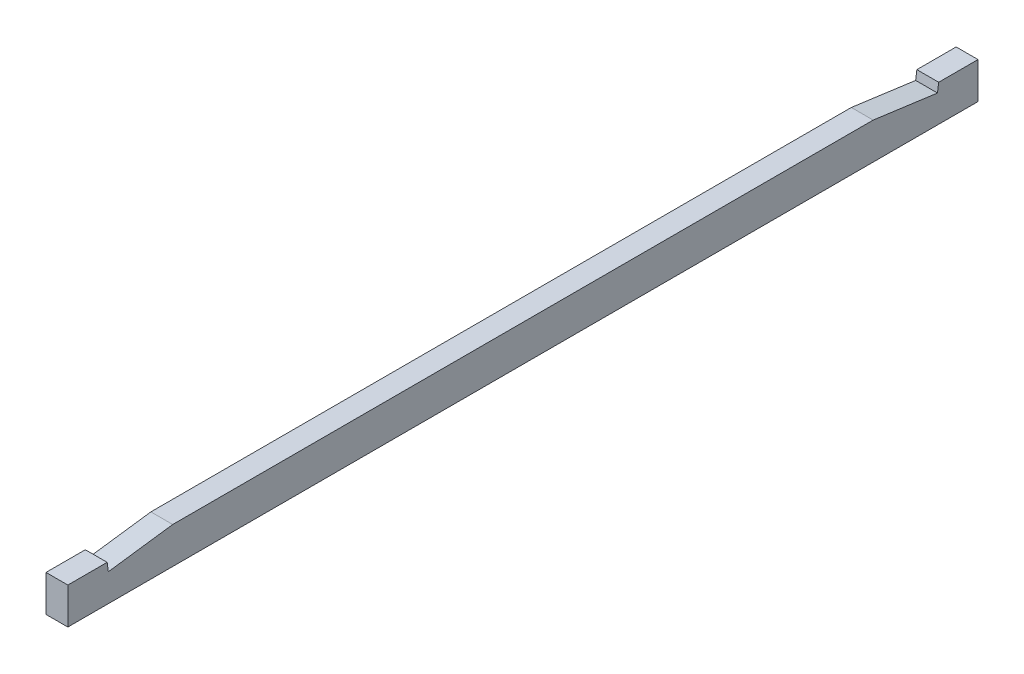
ISO-10303-21;
HEADER;
FILE_DESCRIPTION(('STEP AP214'),'2;1');
FILE_NAME('part.step','',(''),(''),'','','');
FILE_SCHEMA(('AUTOMOTIVE_DESIGN { 1 0 10303 214 1 1 1 1 }'));
ENDSEC;
DATA;
#1=APPLICATION_CONTEXT('core data for automotive mechanical design processes');
#2=APPLICATION_PROTOCOL_DEFINITION('international standard','automotive_design',2000,#1);
#3=PRODUCT_CONTEXT('',#1,'mechanical');
#4=PRODUCT('Part','Part','',(#3));
#5=PRODUCT_RELATED_PRODUCT_CATEGORY('part','',(#4));
#6=PRODUCT_DEFINITION_FORMATION('','',#4);
#7=PRODUCT_DEFINITION_CONTEXT('part definition',#1,'design');
#8=PRODUCT_DEFINITION('design','',#6,#7);
#9=PRODUCT_DEFINITION_SHAPE('','',#8);
#10=(LENGTH_UNIT() NAMED_UNIT(*) SI_UNIT(.MILLI.,.METRE.));
#11=(NAMED_UNIT(*) PLANE_ANGLE_UNIT() SI_UNIT($,.RADIAN.));
#12=(NAMED_UNIT(*) SI_UNIT($,.STERADIAN.) SOLID_ANGLE_UNIT());
#13=UNCERTAINTY_MEASURE_WITH_UNIT(LENGTH_MEASURE(1.E-05),#10,'distance_accuracy_value','');
#14=(GEOMETRIC_REPRESENTATION_CONTEXT(3) GLOBAL_UNCERTAINTY_ASSIGNED_CONTEXT((#13)) GLOBAL_UNIT_ASSIGNED_CONTEXT((#10,
#11,#12)) REPRESENTATION_CONTEXT('',''));
#15=CARTESIAN_POINT('',(0.,0.,0.));
#16=DIRECTION('',(0.,0.,1.));
#17=DIRECTION('',(1.,0.,0.));
#18=AXIS2_PLACEMENT_3D('',#15,#16,#17);
#19=CARTESIAN_POINT('',(0.,25.,625.));
#20=DIRECTION('',(0.,-1.,0.));
#21=DIRECTION('',(0.,0.,-1.));
#22=AXIS2_PLACEMENT_3D('',#19,#20,#21);
#23=PLANE('',#22);
#24=DIRECTION('',(0.,0.,-1.));
#25=VECTOR('',#24,1.);
#26=CARTESIAN_POINT('',(0.,25.,625.));
#27=LINE('',#26,#25);
#28=CARTESIAN_POINT('',(0.,25.0000000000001,553.));
#29=VERTEX_POINT('',#28);
#30=CARTESIAN_POINT('',(0.,25.,72.0000000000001));
#31=VERTEX_POINT('',#30);
#32=EDGE_CURVE('E49',#29,#31,#27,.T.);
#33=ORIENTED_EDGE('',*,*,#32,.F.);
#34=DIRECTION('',(-1.,0.,0.));
#35=VECTOR('',#34,1.);
#36=CARTESIAN_POINT('',(15.,25.0000000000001,553.));
#37=LINE('',#36,#35);
#38=CARTESIAN_POINT('',(15.,25.0000000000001,553.));
#39=VERTEX_POINT('',#38);
#40=EDGE_CURVE('E115',#39,#29,#37,.T.);
#41=ORIENTED_EDGE('',*,*,#40,.F.);
#42=DIRECTION('',(0.,0.,-1.));
#43=VECTOR('',#42,1.);
#44=CARTESIAN_POINT('',(15.,25.,625.));
#45=LINE('',#44,#43);
#46=CARTESIAN_POINT('',(15.,25.,72.0000000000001));
#47=VERTEX_POINT('',#46);
#48=EDGE_CURVE('E171',#39,#47,#45,.T.);
#49=ORIENTED_EDGE('',*,*,#48,.T.);
#50=DIRECTION('',(-1.,0.,0.));
#51=VECTOR('',#50,1.);
#52=CARTESIAN_POINT('',(15.,25.,72.0000000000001));
#53=LINE('',#52,#51);
#54=EDGE_CURVE('E143',#47,#31,#53,.T.);
#55=ORIENTED_EDGE('',*,*,#54,.T.);
#56=EDGE_LOOP('',(#33,#41,#49,#55));
#57=FACE_BOUND('',#56,.T.);
#58=ADVANCED_FACE('F26',(#57),#23,.F.);
#59=CARTESIAN_POINT('',(0.,25.,27.));
#60=VERTEX_POINT('',#59);
#61=CARTESIAN_POINT('',(0.,25.,0.));
#62=VERTEX_POINT('',#61);
#63=EDGE_CURVE('E166',#60,#62,#27,.T.);
#64=ORIENTED_EDGE('',*,*,#63,.F.);
#65=DIRECTION('',(-1.,0.,0.));
#66=VECTOR('',#65,1.);
#67=CARTESIAN_POINT('',(15.,25.,27.));
#68=LINE('',#67,#66);
#69=CARTESIAN_POINT('',(15.,25.,27.));
#70=VERTEX_POINT('',#69);
#71=EDGE_CURVE('E140',#70,#60,#68,.T.);
#72=ORIENTED_EDGE('',*,*,#71,.F.);
#73=CARTESIAN_POINT('',(15.,25.,0.));
#74=VERTEX_POINT('',#73);
#75=EDGE_CURVE('E168',#70,#74,#45,.T.);
#76=ORIENTED_EDGE('',*,*,#75,.T.);
#77=DIRECTION('',(-1.,0.,0.));
#78=VECTOR('',#77,1.);
#79=CARTESIAN_POINT('',(0.,25.,0.));
#80=LINE('',#79,#78);
#81=EDGE_CURVE('E154',#74,#62,#80,.T.);
#82=ORIENTED_EDGE('',*,*,#81,.T.);
#83=EDGE_LOOP('',(#64,#72,#76,#82));
#84=FACE_BOUND('',#83,.T.);
#85=ADVANCED_FACE('F188',(#84),#23,.F.);
#86=CARTESIAN_POINT('',(0.,0.,625.));
#87=DIRECTION('',(1.,0.,0.));
#88=DIRECTION('',(0.,0.,-1.));
#89=AXIS2_PLACEMENT_3D('',#86,#87,#88);
#90=PLANE('',#89);
#91=DIRECTION('',(0.,0.990905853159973,0.134557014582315));
#92=VECTOR('',#91,1.);
#93=CARTESIAN_POINT('',(0.,25.0000000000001,598.));
#94=LINE('',#93,#92);
#95=CARTESIAN_POINT('',(0.,19.0000000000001,597.185248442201));
#96=VERTEX_POINT('',#95);
#97=CARTESIAN_POINT('',(0.,25.,598.));
#98=VERTEX_POINT('',#97);
#99=EDGE_CURVE('E41',#96,#98,#94,.T.);
#100=ORIENTED_EDGE('',*,*,#99,.F.);
#101=DIRECTION('',(0.,-0.1345570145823,0.990905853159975));
#102=VECTOR('',#101,1.);
#103=CARTESIAN_POINT('',(0.,19.0000000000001,597.185248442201));
#104=LINE('',#103,#102);
#105=EDGE_CURVE('E112',#29,#96,#104,.T.);
#106=ORIENTED_EDGE('',*,*,#105,.F.);
#107=ORIENTED_EDGE('',*,*,#32,.T.);
#108=DIRECTION('',(0.,0.1345570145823,0.990905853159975));
#109=VECTOR('',#108,1.);
#110=CARTESIAN_POINT('',(0.,19.,27.8147515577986));
#111=LINE('',#110,#109);
#112=CARTESIAN_POINT('',(0.,19.,27.8147515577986));
#113=VERTEX_POINT('',#112);
#114=EDGE_CURVE('E131',#113,#31,#111,.T.);
#115=ORIENTED_EDGE('',*,*,#114,.F.);
#116=DIRECTION('',(0.,-0.990905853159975,0.134557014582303));
#117=VECTOR('',#116,1.);
#118=CARTESIAN_POINT('',(0.,25.,27.));
#119=LINE('',#118,#117);
#120=EDGE_CURVE('E127',#60,#113,#119,.T.);
#121=ORIENTED_EDGE('',*,*,#120,.F.);
#122=ORIENTED_EDGE('',*,*,#63,.T.);
#123=DIRECTION('',(0.,-1.,0.));
#124=VECTOR('',#123,1.);
#125=CARTESIAN_POINT('',(0.,0.,0.));
#126=LINE('',#125,#124);
#127=CARTESIAN_POINT('',(0.,0.,0.));
#128=VERTEX_POINT('',#127);
#129=EDGE_CURVE('E142',#62,#128,#126,.T.);
#130=ORIENTED_EDGE('',*,*,#129,.T.);
#131=DIRECTION('',(0.,0.,-1.));
#132=VECTOR('',#131,1.);
#133=CARTESIAN_POINT('',(0.,0.,625.));
#134=LINE('',#133,#132);
#135=CARTESIAN_POINT('',(0.,0.,625.));
#136=VERTEX_POINT('',#135);
#137=EDGE_CURVE('E11',#136,#128,#134,.T.);
#138=ORIENTED_EDGE('',*,*,#137,.F.);
#139=DIRECTION('',(0.,-1.,0.));
#140=VECTOR('',#139,1.);
#141=CARTESIAN_POINT('',(0.,0.,625.));
#142=LINE('',#141,#140);
#143=CARTESIAN_POINT('',(0.,25.,625.));
#144=VERTEX_POINT('',#143);
#145=EDGE_CURVE('E157',#144,#136,#142,.T.);
#146=ORIENTED_EDGE('',*,*,#145,.F.);
#147=EDGE_CURVE('E120',#144,#98,#27,.T.);
#148=ORIENTED_EDGE('',*,*,#147,.T.);
#149=EDGE_LOOP('',(#100,#106,#107,#115,#121,#122,#130,#138,#146,#148));
#150=FACE_BOUND('',#149,.T.);
#151=ADVANCED_FACE('F28',(#150),#90,.F.);
#152=CARTESIAN_POINT('',(0.,0.,625.));
#153=DIRECTION('',(0.,1.,0.));
#154=DIRECTION('',(0.,0.,1.));
#155=AXIS2_PLACEMENT_3D('',#152,#153,#154);
#156=PLANE('',#155);
#157=DIRECTION('',(1.,0.,0.));
#158=VECTOR('',#157,1.);
#159=CARTESIAN_POINT('',(0.,0.,0.));
#160=LINE('',#159,#158);
#161=CARTESIAN_POINT('',(15.,0.,0.));
#162=VERTEX_POINT('',#161);
#163=EDGE_CURVE('E149',#128,#162,#160,.T.);
#164=ORIENTED_EDGE('',*,*,#163,.T.);
#165=DIRECTION('',(0.,0.,-1.));
#166=VECTOR('',#165,1.);
#167=CARTESIAN_POINT('',(15.,0.,625.));
#168=LINE('',#167,#166);
#169=CARTESIAN_POINT('',(15.,0.,625.));
#170=VERTEX_POINT('',#169);
#171=EDGE_CURVE('E34',#170,#162,#168,.T.);
#172=ORIENTED_EDGE('',*,*,#171,.F.);
#173=DIRECTION('',(1.,0.,0.));
#174=VECTOR('',#173,1.);
#175=CARTESIAN_POINT('',(0.,0.,625.));
#176=LINE('',#175,#174);
#177=EDGE_CURVE('E160',#136,#170,#176,.T.);
#178=ORIENTED_EDGE('',*,*,#177,.F.);
#179=ORIENTED_EDGE('',*,*,#137,.T.);
#180=EDGE_LOOP('',(#164,#172,#178,#179));
#181=FACE_BOUND('',#180,.T.);
#182=ADVANCED_FACE('F199',(#181),#156,.F.);
#183=CARTESIAN_POINT('',(15.,0.,625.));
#184=DIRECTION('',(-1.,0.,0.));
#185=DIRECTION('',(0.,0.,1.));
#186=AXIS2_PLACEMENT_3D('',#183,#184,#185);
#187=PLANE('',#186);
#188=ORIENTED_EDGE('',*,*,#48,.F.);
#189=DIRECTION('',(0.,-0.1345570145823,0.990905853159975));
#190=VECTOR('',#189,1.);
#191=CARTESIAN_POINT('',(15.,19.0000000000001,597.185248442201));
#192=LINE('',#191,#190);
#193=CARTESIAN_POINT('',(15.,19.0000000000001,597.185248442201));
#194=VERTEX_POINT('',#193);
#195=EDGE_CURVE('E121',#39,#194,#192,.T.);
#196=ORIENTED_EDGE('',*,*,#195,.T.);
#197=DIRECTION('',(0.,0.990905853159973,0.134557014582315));
#198=VECTOR('',#197,1.);
#199=CARTESIAN_POINT('',(15.,25.0000000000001,598.));
#200=LINE('',#199,#198);
#201=CARTESIAN_POINT('',(15.,25.0000000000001,598.));
#202=VERTEX_POINT('',#201);
#203=EDGE_CURVE('E107',#194,#202,#200,.T.);
#204=ORIENTED_EDGE('',*,*,#203,.T.);
#205=CARTESIAN_POINT('',(15.,25.,625.));
#206=VERTEX_POINT('',#205);
#207=EDGE_CURVE('E169',#206,#202,#45,.T.);
#208=ORIENTED_EDGE('',*,*,#207,.F.);
#209=DIRECTION('',(0.,1.,0.));
#210=VECTOR('',#209,1.);
#211=CARTESIAN_POINT('',(15.,0.,625.));
#212=LINE('',#211,#210);
#213=EDGE_CURVE('E162',#170,#206,#212,.T.);
#214=ORIENTED_EDGE('',*,*,#213,.F.);
#215=ORIENTED_EDGE('',*,*,#171,.T.);
#216=DIRECTION('',(0.,1.,0.));
#217=VECTOR('',#216,1.);
#218=CARTESIAN_POINT('',(15.,0.,0.));
#219=LINE('',#218,#217);
#220=EDGE_CURVE('E151',#162,#74,#219,.T.);
#221=ORIENTED_EDGE('',*,*,#220,.T.);
#222=ORIENTED_EDGE('',*,*,#75,.F.);
#223=DIRECTION('',(0.,-0.990905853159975,0.134557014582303));
#224=VECTOR('',#223,1.);
#225=CARTESIAN_POINT('',(15.,25.,27.));
#226=LINE('',#225,#224);
#227=CARTESIAN_POINT('',(15.,19.,27.8147515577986));
#228=VERTEX_POINT('',#227);
#229=EDGE_CURVE('E133',#70,#228,#226,.T.);
#230=ORIENTED_EDGE('',*,*,#229,.T.);
#231=DIRECTION('',(0.,0.1345570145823,0.990905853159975));
#232=VECTOR('',#231,1.);
#233=CARTESIAN_POINT('',(15.,19.,27.8147515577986));
#234=LINE('',#233,#232);
#235=EDGE_CURVE('E136',#228,#47,#234,.T.);
#236=ORIENTED_EDGE('',*,*,#235,.T.);
#237=EDGE_LOOP('',(#188,#196,#204,#208,#214,#215,#221,#222,#230,#236));
#238=FACE_BOUND('',#237,.T.);
#239=ADVANCED_FACE('F178',(#238),#187,.F.);
#240=ORIENTED_EDGE('',*,*,#207,.T.);
#241=DIRECTION('',(-1.,0.,0.));
#242=VECTOR('',#241,1.);
#243=CARTESIAN_POINT('',(15.,25.0000000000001,598.));
#244=LINE('',#243,#242);
#245=EDGE_CURVE('E110',#202,#98,#244,.T.);
#246=ORIENTED_EDGE('',*,*,#245,.T.);
#247=ORIENTED_EDGE('',*,*,#147,.F.);
#248=DIRECTION('',(-1.,0.,0.));
#249=VECTOR('',#248,1.);
#250=CARTESIAN_POINT('',(0.,25.,625.));
#251=LINE('',#250,#249);
#252=EDGE_CURVE('E164',#206,#144,#251,.T.);
#253=ORIENTED_EDGE('',*,*,#252,.F.);
#254=EDGE_LOOP('',(#240,#246,#247,#253));
#255=FACE_BOUND('',#254,.T.);
#256=ADVANCED_FACE('F204',(#255),#23,.F.);
#257=CARTESIAN_POINT('',(0.,25.,625.));
#258=DIRECTION('',(0.,0.,-1.));
#259=DIRECTION('',(-1.,0.,0.));
#260=AXIS2_PLACEMENT_3D('',#257,#258,#259);
#261=PLANE('',#260);
#262=ORIENTED_EDGE('',*,*,#145,.T.);
#263=ORIENTED_EDGE('',*,*,#177,.T.);
#264=ORIENTED_EDGE('',*,*,#213,.T.);
#265=ORIENTED_EDGE('',*,*,#252,.T.);
#266=EDGE_LOOP('',(#262,#263,#264,#265));
#267=FACE_BOUND('',#266,.T.);
#268=ADVANCED_FACE('F201',(#267),#261,.F.);
#269=CARTESIAN_POINT('',(0.,25.,0.));
#270=DIRECTION('',(0.,0.,-1.));
#271=DIRECTION('',(-1.,0.,0.));
#272=AXIS2_PLACEMENT_3D('',#269,#270,#271);
#273=PLANE('',#272);
#274=ORIENTED_EDGE('',*,*,#129,.F.);
#275=ORIENTED_EDGE('',*,*,#81,.F.);
#276=ORIENTED_EDGE('',*,*,#220,.F.);
#277=ORIENTED_EDGE('',*,*,#163,.F.);
#278=EDGE_LOOP('',(#274,#275,#276,#277));
#279=FACE_BOUND('',#278,.T.);
#280=ADVANCED_FACE('F185',(#279),#273,.T.);
#281=CARTESIAN_POINT('',(15.,25.,27.));
#282=DIRECTION('',(0.,-0.134557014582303,-0.990905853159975));
#283=DIRECTION('',(0.,0.990905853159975,-0.134557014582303));
#284=AXIS2_PLACEMENT_3D('',#281,#282,#283);
#285=PLANE('',#284);
#286=ORIENTED_EDGE('',*,*,#120,.T.);
#287=DIRECTION('',(-1.,0.,0.));
#288=VECTOR('',#287,1.);
#289=CARTESIAN_POINT('',(15.,19.,27.8147515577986));
#290=LINE('',#289,#288);
#291=EDGE_CURVE('E139',#228,#113,#290,.T.);
#292=ORIENTED_EDGE('',*,*,#291,.F.);
#293=ORIENTED_EDGE('',*,*,#229,.F.);
#294=ORIENTED_EDGE('',*,*,#71,.T.);
#295=EDGE_LOOP('',(#286,#292,#293,#294));
#296=FACE_BOUND('',#295,.T.);
#297=ADVANCED_FACE('F196',(#296),#285,.F.);
#298=CARTESIAN_POINT('',(15.,19.,27.8147515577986));
#299=DIRECTION('',(0.,-0.990905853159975,0.1345570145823));
#300=DIRECTION('',(0.,-0.1345570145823,-0.990905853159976));
#301=AXIS2_PLACEMENT_3D('',#298,#299,#300);
#302=PLANE('',#301);
#303=ORIENTED_EDGE('',*,*,#114,.T.);
#304=ORIENTED_EDGE('',*,*,#54,.F.);
#305=ORIENTED_EDGE('',*,*,#235,.F.);
#306=ORIENTED_EDGE('',*,*,#291,.T.);
#307=EDGE_LOOP('',(#303,#304,#305,#306));
#308=FACE_BOUND('',#307,.T.);
#309=ADVANCED_FACE('F194',(#308),#302,.F.);
#310=CARTESIAN_POINT('',(15.,19.0000000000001,597.185248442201));
#311=DIRECTION('',(0.,-0.990905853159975,-0.1345570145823));
#312=DIRECTION('',(0.,0.1345570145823,-0.990905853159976));
#313=AXIS2_PLACEMENT_3D('',#310,#311,#312);
#314=PLANE('',#313);
#315=ORIENTED_EDGE('',*,*,#105,.T.);
#316=DIRECTION('',(-1.,0.,0.));
#317=VECTOR('',#316,1.);
#318=CARTESIAN_POINT('',(15.,19.0000000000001,597.185248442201));
#319=LINE('',#318,#317);
#320=EDGE_CURVE('E103',#194,#96,#319,.T.);
#321=ORIENTED_EDGE('',*,*,#320,.F.);
#322=ORIENTED_EDGE('',*,*,#195,.F.);
#323=ORIENTED_EDGE('',*,*,#40,.T.);
#324=EDGE_LOOP('',(#315,#321,#322,#323));
#325=FACE_BOUND('',#324,.T.);
#326=ADVANCED_FACE('F113',(#325),#314,.F.);
#327=CARTESIAN_POINT('',(15.,25.0000000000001,598.));
#328=DIRECTION('',(0.,-0.134557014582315,0.990905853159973));
#329=DIRECTION('',(0.,-0.990905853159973,-0.134557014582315));
#330=AXIS2_PLACEMENT_3D('',#327,#328,#329);
#331=PLANE('',#330);
#332=ORIENTED_EDGE('',*,*,#99,.T.);
#333=ORIENTED_EDGE('',*,*,#245,.F.);
#334=ORIENTED_EDGE('',*,*,#203,.F.);
#335=ORIENTED_EDGE('',*,*,#320,.T.);
#336=EDGE_LOOP('',(#332,#333,#334,#335));
#337=FACE_BOUND('',#336,.T.);
#338=ADVANCED_FACE('F105',(#337),#331,.F.);
#339=CLOSED_SHELL('',(#58,#85,#151,#182,#239,#256,#268,#280,#297,#309,#326,#338));
#340=MANIFOLD_SOLID_BREP('B2',#339);
#341=ADVANCED_BREP_SHAPE_REPRESENTATION('',(#18,#340),#14);
#342=SHAPE_DEFINITION_REPRESENTATION(#9,#341);
ENDSEC;
END-ISO-10303-21;
